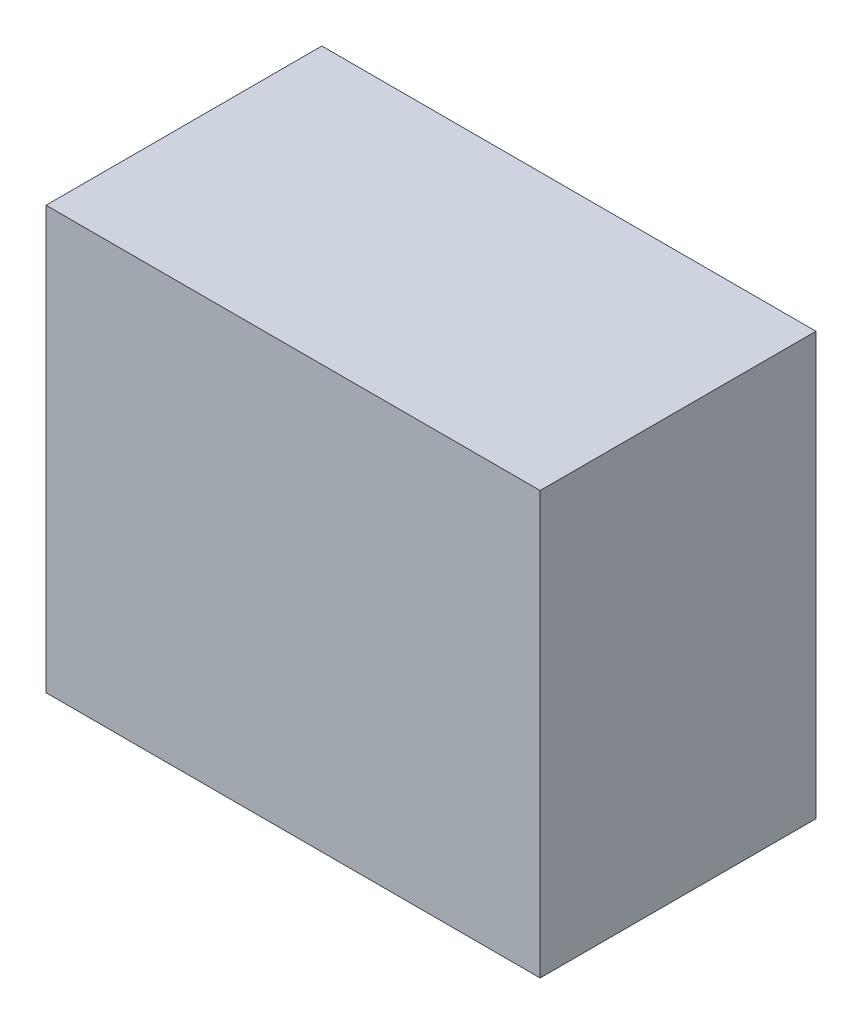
ISO-10303-21;
HEADER;
FILE_DESCRIPTION(('STEP AP214'),'2;1');
FILE_NAME('part.step','',(''),(''),'','','');
FILE_SCHEMA(('AUTOMOTIVE_DESIGN { 1 0 10303 214 1 1 1 1 }'));
ENDSEC;
DATA;
#1=APPLICATION_CONTEXT('core data for automotive mechanical design processes');
#2=APPLICATION_PROTOCOL_DEFINITION('international standard','automotive_design',2000,#1);
#3=PRODUCT_CONTEXT('',#1,'mechanical');
#4=PRODUCT('Part','Part','',(#3));
#5=PRODUCT_RELATED_PRODUCT_CATEGORY('part','',(#4));
#6=PRODUCT_DEFINITION_FORMATION('','',#4);
#7=PRODUCT_DEFINITION_CONTEXT('part definition',#1,'design');
#8=PRODUCT_DEFINITION('design','',#6,#7);
#9=PRODUCT_DEFINITION_SHAPE('','',#8);
#10=(LENGTH_UNIT() NAMED_UNIT(*) SI_UNIT(.MILLI.,.METRE.));
#11=(NAMED_UNIT(*) PLANE_ANGLE_UNIT() SI_UNIT($,.RADIAN.));
#12=(NAMED_UNIT(*) SI_UNIT($,.STERADIAN.) SOLID_ANGLE_UNIT());
#13=UNCERTAINTY_MEASURE_WITH_UNIT(LENGTH_MEASURE(1.E-05),#10,'distance_accuracy_value','');
#14=(GEOMETRIC_REPRESENTATION_CONTEXT(3) GLOBAL_UNCERTAINTY_ASSIGNED_CONTEXT((#13)) GLOBAL_UNIT_ASSIGNED_CONTEXT((#10,
#11,#12)) REPRESENTATION_CONTEXT('',''));
#15=CARTESIAN_POINT('',(0.,0.,0.));
#16=DIRECTION('',(0.,0.,1.));
#17=DIRECTION('',(1.,0.,0.));
#18=AXIS2_PLACEMENT_3D('',#15,#16,#17);
#19=CARTESIAN_POINT('',(-90.1151952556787,67.3125657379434,150.));
#20=DIRECTION('',(1.,0.,0.));
#21=DIRECTION('',(0.,0.,-1.));
#22=AXIS2_PLACEMENT_3D('',#19,#20,#21);
#23=PLANE('',#22);
#24=DIRECTION('',(0.,-1.,0.));
#25=VECTOR('',#24,1.);
#26=CARTESIAN_POINT('',(-90.1151952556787,67.3125657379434,0.));
#27=LINE('',#26,#25);
#28=CARTESIAN_POINT('',(-90.1151952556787,67.3125657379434,0.));
#29=VERTEX_POINT('',#28);
#30=CARTESIAN_POINT('',(-90.1151952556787,-162.29195021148,0.));
#31=VERTEX_POINT('',#30);
#32=EDGE_CURVE('E70',#29,#31,#27,.T.);
#33=ORIENTED_EDGE('',*,*,#32,.T.);
#34=DIRECTION('',(0.,0.,-1.));
#35=VECTOR('',#34,1.);
#36=CARTESIAN_POINT('',(-90.1151952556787,-162.29195021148,150.));
#37=LINE('',#36,#35);
#38=CARTESIAN_POINT('',(-90.1151952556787,-162.29195021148,150.));
#39=VERTEX_POINT('',#38);
#40=EDGE_CURVE('E11',#39,#31,#37,.T.);
#41=ORIENTED_EDGE('',*,*,#40,.F.);
#42=DIRECTION('',(0.,-1.,0.));
#43=VECTOR('',#42,1.);
#44=CARTESIAN_POINT('',(-90.1151952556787,67.3125657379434,150.));
#45=LINE('',#44,#43);
#46=CARTESIAN_POINT('',(-90.1151952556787,67.3125657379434,150.));
#47=VERTEX_POINT('',#46);
#48=EDGE_CURVE('E88',#47,#39,#45,.T.);
#49=ORIENTED_EDGE('',*,*,#48,.F.);
#50=DIRECTION('',(0.,0.,-1.));
#51=VECTOR('',#50,1.);
#52=CARTESIAN_POINT('',(-90.1151952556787,67.3125657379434,150.));
#53=LINE('',#52,#51);
#54=EDGE_CURVE('E82',#47,#29,#53,.T.);
#55=ORIENTED_EDGE('',*,*,#54,.T.);
#56=EDGE_LOOP('',(#33,#41,#49,#55));
#57=FACE_BOUND('',#56,.T.);
#58=ADVANCED_FACE('F26',(#57),#23,.F.);
#59=CARTESIAN_POINT('',(-90.1151952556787,-162.29195021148,150.));
#60=DIRECTION('',(0.,1.,0.));
#61=DIRECTION('',(0.,0.,1.));
#62=AXIS2_PLACEMENT_3D('',#59,#60,#61);
#63=PLANE('',#62);
#64=DIRECTION('',(1.,0.,0.));
#65=VECTOR('',#64,1.);
#66=CARTESIAN_POINT('',(-90.1151952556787,-162.29195021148,0.));
#67=LINE('',#66,#65);
#68=CARTESIAN_POINT('',(178.603736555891,-162.29195021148,0.));
#69=VERTEX_POINT('',#68);
#70=EDGE_CURVE('E66',#31,#69,#67,.T.);
#71=ORIENTED_EDGE('',*,*,#70,.T.);
#72=DIRECTION('',(0.,0.,-1.));
#73=VECTOR('',#72,1.);
#74=CARTESIAN_POINT('',(178.603736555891,-162.29195021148,150.));
#75=LINE('',#74,#73);
#76=CARTESIAN_POINT('',(178.603736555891,-162.29195021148,150.));
#77=VERTEX_POINT('',#76);
#78=EDGE_CURVE('E33',#77,#69,#75,.T.);
#79=ORIENTED_EDGE('',*,*,#78,.F.);
#80=DIRECTION('',(1.,0.,0.));
#81=VECTOR('',#80,1.);
#82=CARTESIAN_POINT('',(-90.1151952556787,-162.29195021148,150.));
#83=LINE('',#82,#81);
#84=EDGE_CURVE('E78',#39,#77,#83,.T.);
#85=ORIENTED_EDGE('',*,*,#84,.F.);
#86=ORIENTED_EDGE('',*,*,#40,.T.);
#87=EDGE_LOOP('',(#71,#79,#85,#86));
#88=FACE_BOUND('',#87,.T.);
#89=ADVANCED_FACE('F77',(#88),#63,.F.);
#90=CARTESIAN_POINT('',(178.603736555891,67.3125657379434,150.));
#91=DIRECTION('',(-1.,0.,0.));
#92=DIRECTION('',(0.,-1.,0.));
#93=AXIS2_PLACEMENT_3D('',#90,#91,#92);
#94=PLANE('',#93);
#95=DIRECTION('',(0.,1.,0.));
#96=VECTOR('',#95,1.);
#97=CARTESIAN_POINT('',(178.603736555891,67.3125657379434,0.));
#98=LINE('',#97,#96);
#99=CARTESIAN_POINT('',(178.603736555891,67.3125657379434,0.));
#100=VERTEX_POINT('',#99);
#101=EDGE_CURVE('E71',#69,#100,#98,.T.);
#102=ORIENTED_EDGE('',*,*,#101,.T.);
#103=DIRECTION('',(0.,0.,-1.));
#104=VECTOR('',#103,1.);
#105=CARTESIAN_POINT('',(178.603736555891,67.3125657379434,150.));
#106=LINE('',#105,#104);
#107=CARTESIAN_POINT('',(178.603736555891,67.3125657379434,150.));
#108=VERTEX_POINT('',#107);
#109=EDGE_CURVE('E94',#108,#100,#106,.T.);
#110=ORIENTED_EDGE('',*,*,#109,.F.);
#111=DIRECTION('',(0.,1.,0.));
#112=VECTOR('',#111,1.);
#113=CARTESIAN_POINT('',(178.603736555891,67.3125657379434,150.));
#114=LINE('',#113,#112);
#115=EDGE_CURVE('E45',#77,#108,#114,.T.);
#116=ORIENTED_EDGE('',*,*,#115,.F.);
#117=ORIENTED_EDGE('',*,*,#78,.T.);
#118=EDGE_LOOP('',(#102,#110,#116,#117));
#119=FACE_BOUND('',#118,.T.);
#120=ADVANCED_FACE('F97',(#119),#94,.F.);
#121=CARTESIAN_POINT('',(-90.1151952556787,67.3125657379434,150.));
#122=DIRECTION('',(0.,-1.,0.));
#123=DIRECTION('',(0.,0.,-1.));
#124=AXIS2_PLACEMENT_3D('',#121,#122,#123);
#125=PLANE('',#124);
#126=DIRECTION('',(-1.,0.,0.));
#127=VECTOR('',#126,1.);
#128=CARTESIAN_POINT('',(-90.1151952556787,67.3125657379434,0.));
#129=LINE('',#128,#127);
#130=EDGE_CURVE('E86',#100,#29,#129,.T.);
#131=ORIENTED_EDGE('',*,*,#130,.T.);
#132=ORIENTED_EDGE('',*,*,#54,.F.);
#133=DIRECTION('',(-1.,0.,0.));
#134=VECTOR('',#133,1.);
#135=CARTESIAN_POINT('',(-90.1151952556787,67.3125657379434,150.));
#136=LINE('',#135,#134);
#137=EDGE_CURVE('E40',#108,#47,#136,.T.);
#138=ORIENTED_EDGE('',*,*,#137,.F.);
#139=ORIENTED_EDGE('',*,*,#109,.T.);
#140=EDGE_LOOP('',(#131,#132,#138,#139));
#141=FACE_BOUND('',#140,.T.);
#142=ADVANCED_FACE('F99',(#141),#125,.F.);
#143=CARTESIAN_POINT('',(-90.1151952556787,-162.29195021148,150.));
#144=DIRECTION('',(0.,0.,1.));
#145=DIRECTION('',(1.,0.,0.));
#146=AXIS2_PLACEMENT_3D('',#143,#144,#145);
#147=PLANE('',#146);
#148=ORIENTED_EDGE('',*,*,#48,.T.);
#149=ORIENTED_EDGE('',*,*,#84,.T.);
#150=ORIENTED_EDGE('',*,*,#115,.T.);
#151=ORIENTED_EDGE('',*,*,#137,.T.);
#152=EDGE_LOOP('',(#148,#149,#150,#151));
#153=FACE_BOUND('',#152,.T.);
#154=ADVANCED_FACE('F100',(#153),#147,.T.);
#155=CARTESIAN_POINT('',(-90.1151952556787,-162.29195021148,0.));
#156=DIRECTION('',(0.,0.,1.));
#157=DIRECTION('',(1.,0.,0.));
#158=AXIS2_PLACEMENT_3D('',#155,#156,#157);
#159=PLANE('',#158);
#160=ORIENTED_EDGE('',*,*,#32,.F.);
#161=ORIENTED_EDGE('',*,*,#130,.F.);
#162=ORIENTED_EDGE('',*,*,#101,.F.);
#163=ORIENTED_EDGE('',*,*,#70,.F.);
#164=EDGE_LOOP('',(#160,#161,#162,#163));
#165=FACE_BOUND('',#164,.T.);
#166=ADVANCED_FACE('F67',(#165),#159,.F.);
#167=CLOSED_SHELL('',(#58,#89,#120,#142,#154,#166));
#168=MANIFOLD_SOLID_BREP('B2',#167);
#169=ADVANCED_BREP_SHAPE_REPRESENTATION('',(#18,#168),#14);
#170=SHAPE_DEFINITION_REPRESENTATION(#9,#169);
ENDSEC;
END-ISO-10303-21;
